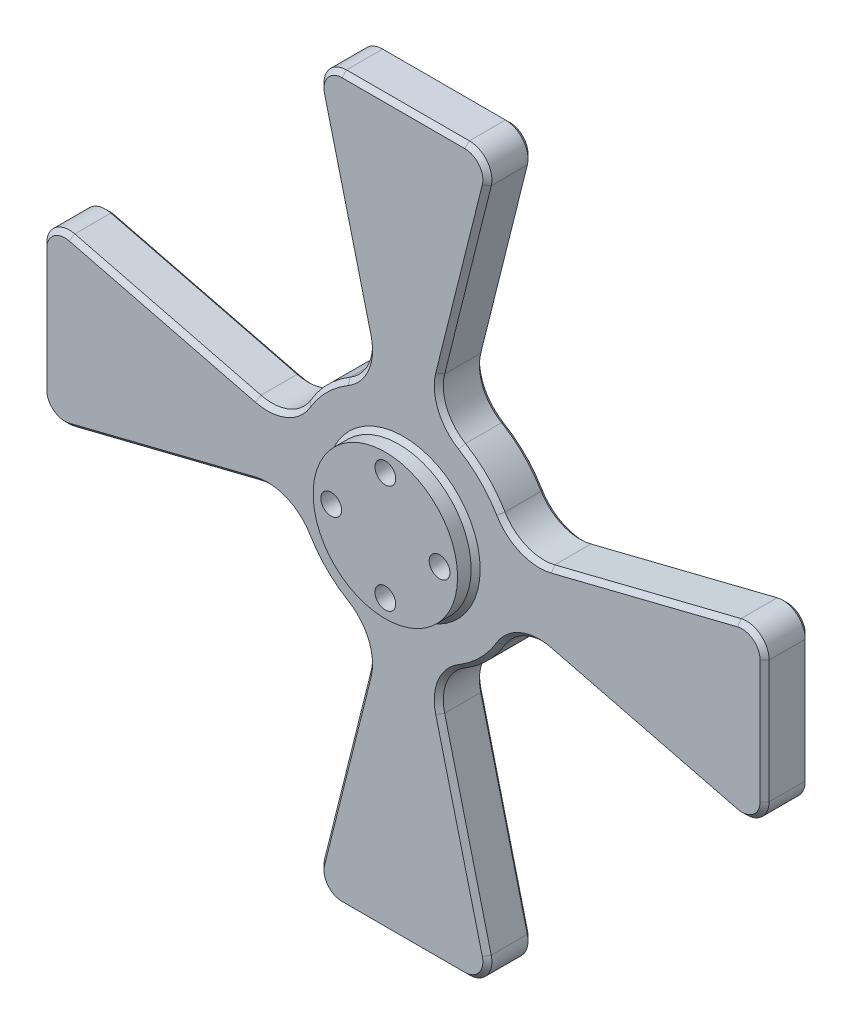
from build123d import *

# Parameters (mm, degrees)
SKIZZE1_R                       = 12.5
AUFSATZ_LINEAR_AUSTRAGEN1_DEPTH = 5
SKIZZE2_R                       = 8
AUFSATZ_LINEAR_AUSTRAGEN2_DEPTH = 2
AUFSATZ_LINEAR_AUSTRAGEN3_DEPTH = 5
KREISMUSTER1_COUNT              = 4
SKIZZE3_R                       = 1.15
SCHNITT_LINEAR_AUSTRAGEN1_DEPTH = 12
VERRUNDUNG1_R                   = 5
FASE1_SIZE                      = 0.5


with BuildPart() as part:
    # Skizze1 → Aufsatz-Linear austragen1 (new body)
    with BuildSketch(Plane.XY):
        Circle(SKIZZE1_R)
    extrude(amount=AUFSATZ_LINEAR_AUSTRAGEN1_DEPTH)

    # Skizze2 → Aufsatz-Linear austragen2 (add)
    with BuildSketch(Plane.XY.offset(5)):
        Circle(SKIZZE2_R)
    extrude(amount=AUFSATZ_LINEAR_AUSTRAGEN2_DEPTH)

    # Skizze6 → Aufsatz-Linear austragen3 (add)
    with BuildSketch(Plane(origin=(0, 0, 0), x_dir=(-1, 0, 0), z_dir=(0, 0, -1))):
        with BuildLine():
            Line((0, 0), (9.223415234, 36.893660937))
            ThreePointArc((9.223415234, 36.893660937), (8.768572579, 39.038530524), (6.798058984, 40))
            Line((6.798058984, 40), (-6.798058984, 40))
            ThreePointArc((-6.798058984, 40), (-8.768572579, 39.038530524), (-9.223415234, 36.893660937))
            Line((-9.223415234, 36.893660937), (0, 0))
        make_face()
    aufsatz_linear_austragen3 = extrude(amount=-AUFSATZ_LINEAR_AUSTRAGEN3_DEPTH)

    # Kreismuster1: Aufsatz-Linear austragen3 ×4 about axis
    kreismuster1_axis = Axis((0, 0, 0), (0, 0, 1))
    for i in range(1, KREISMUSTER1_COUNT):
        add(aufsatz_linear_austragen3.rotate(kreismuster1_axis, i * 360 / KREISMUSTER1_COUNT))

    # Skizze3 → Schnitt-Linear austragen1 (cut)
    with BuildSketch(Plane.XY.offset(7)):
        with Locations((0, 6)):
            Circle(SKIZZE3_R)
        with Locations((6, 0)):
            Circle(SKIZZE3_R)
        with Locations((0, -6)):
            Circle(SKIZZE3_R)
        with Locations((-6, 0)):
            Circle(SKIZZE3_R)
    extrude(amount=-SCHNITT_LINEAR_AUSTRAGEN1_DEPTH, mode=Mode.SUBTRACT)

    # Verrundung1
    verrundung1_edges = [part.edges().sort_by_distance(p)[0] for p in [
        (-3.031695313, 12.126781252, 2.5),
        (3.031695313, 12.126781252, 2.5),
        (-12.126781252, -3.031695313, 2.5),
        (-12.126781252, 3.031695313, 2.5),
        (3.031695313, -12.126781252, 2.5),
        (-3.031695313, -12.126781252, 2.5),
        (12.126781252, 3.031695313, 2.5),
        (12.126781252, -3.031695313, 2.5),
    ]]
    fillet(verrundung1_edges, radius=VERRUNDUNG1_R)

    # Fase1
    fase1_edges = [part.edges().sort_by_distance(p)[0] for p in [
        (-8.838834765, 8.838834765, 0),
        (-8.838834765, 8.838834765, 5),
        (-6.645430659, 26.581722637, 5),
        (-6.645430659, 26.581722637, 0),
        (8.838834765, 8.838834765, 5),
        (8.838834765, 8.838834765, 0),
        (26.581722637, 6.645430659, 5),
        (26.581722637, 6.645430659, 0),
        (8.838834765, -8.838834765, 0),
        (8.838834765, -8.838834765, 5),
        (6.645430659, -26.581722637, 5),
        (6.645430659, -26.581722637, 0),
        (-8.838834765, -8.838834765, 0),
        (-8.838834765, -8.838834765, 5),
        (6.645430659, 26.581722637, 5),
        (-26.581722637, -6.645430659, 5),
        (-26.581722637, -6.645430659, 0),
        (-13.130556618, 4.304222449, 5),
        (-13.130556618, 4.304222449, 0),
        (6.645430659, 26.581722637, 0),
        (-4.304222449, 13.130556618, 0),
        (-4.304222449, 13.130556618, 5),
        (4.304222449, 13.130556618, 5),
        (4.304222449, 13.130556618, 0),
        (13.130556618, 4.304222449, 0),
        (13.130556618, 4.304222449, 5),
        (13.130556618, -4.304222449, 5),
        (13.130556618, -4.304222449, 0),
        (-8.768572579, 39.038530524, 0),
        (4.304222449, -13.130556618, 0),
        (4.304222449, -13.130556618, 5),
        (-4.304222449, -13.130556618, 5),
        (0, 40, 0),
        (-4.304222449, -13.130556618, 0),
        (-13.130556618, -4.304222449, 0),
        (-13.130556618, -4.304222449, 5),
        (8.768572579, 39.038530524, 0),
        (-8.768572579, 39.038530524, 5),
        (0, 40, 5),
        (8.768572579, 39.038530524, 5),
        (-26.581722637, 6.645430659, 5),
        (-26.581722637, 6.645430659, 0),
        (-39.038530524, -8.768572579, 0),
        (-40, 0, 0),
        (-39.038530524, 8.768572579, 0),
        (-39.038530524, -8.768572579, 5),
        (-40, 0, 5),
        (-39.038530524, 8.768572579, 5),
        (-8, 0, 5),
        (-6.645430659, -26.581722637, 5),
        (-6.645430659, -26.581722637, 0),
        (8.768572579, -39.038530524, 0),
        (0, -40, 0),
        (-8.768572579, -39.038530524, 0),
        (8.768572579, -39.038530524, 5),
        (0, -40, 5),
        (-8.768572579, -39.038530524, 5),
        (26.581722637, -6.645430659, 5),
        (26.581722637, -6.645430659, 0),
        (39.038530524, 8.768572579, 0),
        (40, 0, 0),
        (39.038530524, -8.768572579, 0),
        (39.038530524, 8.768572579, 5),
        (40, 0, 5),
        (39.038530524, -8.768572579, 5),
    ]]
    chamfer(fase1_edges, length=FASE1_SIZE)


solid = part.part
